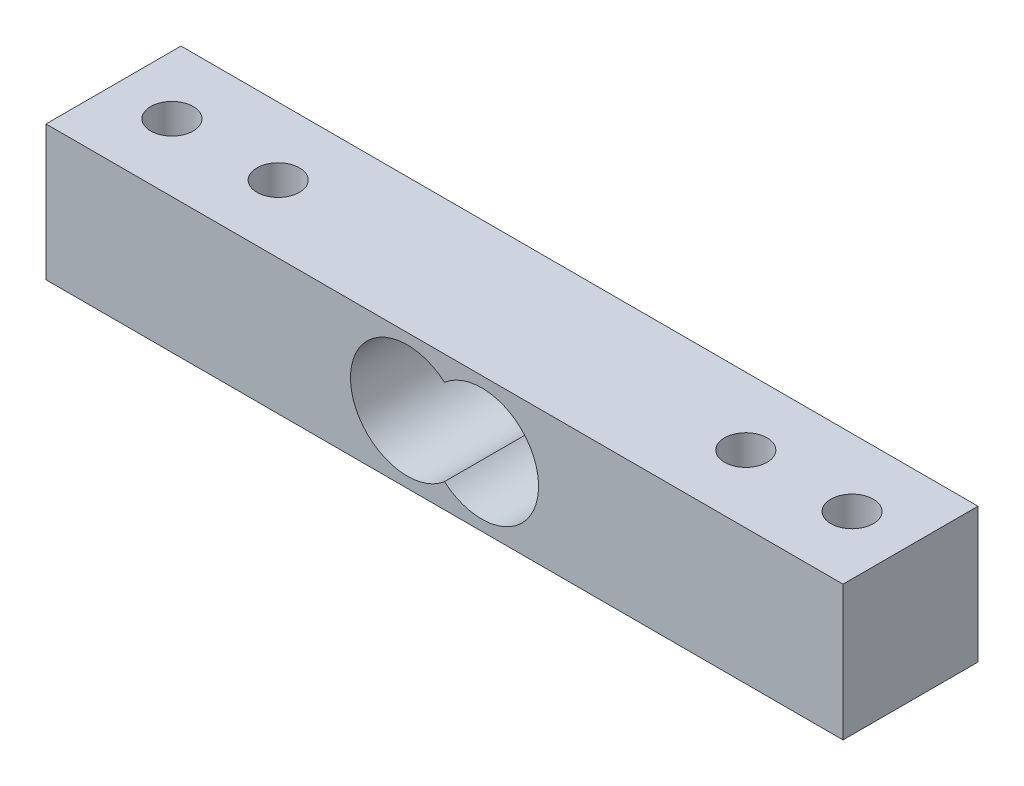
ISO-10303-21;
HEADER;
FILE_DESCRIPTION(('STEP AP214'),'2;1');
FILE_NAME('part.step','',(''),(''),'','','');
FILE_SCHEMA(('AUTOMOTIVE_DESIGN { 1 0 10303 214 1 1 1 1 }'));
ENDSEC;
DATA;
#1=APPLICATION_CONTEXT('core data for automotive mechanical design processes');
#2=APPLICATION_PROTOCOL_DEFINITION('international standard','automotive_design',2000,#1);
#3=PRODUCT_CONTEXT('',#1,'mechanical');
#4=PRODUCT('Part','Part','',(#3));
#5=PRODUCT_RELATED_PRODUCT_CATEGORY('part','',(#4));
#6=PRODUCT_DEFINITION_FORMATION('','',#4);
#7=PRODUCT_DEFINITION_CONTEXT('part definition',#1,'design');
#8=PRODUCT_DEFINITION('design','',#6,#7);
#9=PRODUCT_DEFINITION_SHAPE('','',#8);
#10=(LENGTH_UNIT() NAMED_UNIT(*) SI_UNIT(.MILLI.,.METRE.));
#11=(NAMED_UNIT(*) PLANE_ANGLE_UNIT() SI_UNIT($,.RADIAN.));
#12=(NAMED_UNIT(*) SI_UNIT($,.STERADIAN.) SOLID_ANGLE_UNIT());
#13=UNCERTAINTY_MEASURE_WITH_UNIT(LENGTH_MEASURE(1.E-05),#10,'distance_accuracy_value','');
#14=(GEOMETRIC_REPRESENTATION_CONTEXT(3) GLOBAL_UNCERTAINTY_ASSIGNED_CONTEXT((#13)) GLOBAL_UNIT_ASSIGNED_CONTEXT((#10,
#11,#12)) REPRESENTATION_CONTEXT('',''));
#15=CARTESIAN_POINT('',(0.,0.,0.));
#16=DIRECTION('',(0.,0.,1.));
#17=DIRECTION('',(1.,0.,0.));
#18=AXIS2_PLACEMENT_3D('',#15,#16,#17);
#19=CARTESIAN_POINT('',(0.,12.7,0.));
#20=DIRECTION('',(0.,1.,0.));
#21=DIRECTION('',(0.,0.,1.));
#22=AXIS2_PLACEMENT_3D('',#19,#20,#21);
#23=PLANE('',#22);
#24=CARTESIAN_POINT('',(22.,12.7,0.));
#25=DIRECTION('',(0.,1.,0.));
#26=DIRECTION('',(0.,0.,-1.));
#27=AXIS2_PLACEMENT_3D('',#24,#25,#26);
#28=CIRCLE('',#27,2.);
#29=CARTESIAN_POINT('',(22.,12.7,-2.));
#30=VERTEX_POINT('',#29);
#31=EDGE_CURVE('E130',#30,#30,#28,.T.);
#32=ORIENTED_EDGE('',*,*,#31,.F.);
#33=EDGE_LOOP('',(#32));
#34=FACE_BOUND('',#33,.T.);
#35=CARTESIAN_POINT('',(-22.,12.7,0.));
#36=DIRECTION('',(0.,1.,0.));
#37=DIRECTION('',(0.,0.,1.));
#38=AXIS2_PLACEMENT_3D('',#35,#36,#37);
#39=CIRCLE('',#38,2.);
#40=CARTESIAN_POINT('',(-22.,12.7,2.));
#41=VERTEX_POINT('',#40);
#42=EDGE_CURVE('E146',#41,#41,#39,.T.);
#43=ORIENTED_EDGE('',*,*,#42,.F.);
#44=EDGE_LOOP('',(#43));
#45=FACE_BOUND('',#44,.T.);
#46=DIRECTION('',(0.,0.,1.));
#47=VECTOR('',#46,1.);
#48=CARTESIAN_POINT('',(-37.5,12.7,6.35));
#49=LINE('',#48,#47);
#50=CARTESIAN_POINT('',(-37.5,12.7,-6.35));
#51=VERTEX_POINT('',#50);
#52=CARTESIAN_POINT('',(-37.5,12.7,6.35));
#53=VERTEX_POINT('',#52);
#54=EDGE_CURVE('E154',#51,#53,#49,.T.);
#55=ORIENTED_EDGE('',*,*,#54,.T.);
#56=DIRECTION('',(1.,0.,0.));
#57=VECTOR('',#56,1.);
#58=CARTESIAN_POINT('',(37.5,12.7,6.34999999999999));
#59=LINE('',#58,#57);
#60=CARTESIAN_POINT('',(37.5,12.7,6.34999999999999));
#61=VERTEX_POINT('',#60);
#62=EDGE_CURVE('E158',#53,#61,#59,.T.);
#63=ORIENTED_EDGE('',*,*,#62,.T.);
#64=DIRECTION('',(0.,0.,-1.));
#65=VECTOR('',#64,1.);
#66=CARTESIAN_POINT('',(37.5,12.7,6.34999999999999));
#67=LINE('',#66,#65);
#68=CARTESIAN_POINT('',(37.5,12.7,-6.35000000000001));
#69=VERTEX_POINT('',#68);
#70=EDGE_CURVE('E162',#61,#69,#67,.T.);
#71=ORIENTED_EDGE('',*,*,#70,.T.);
#72=DIRECTION('',(-1.,0.,0.));
#73=VECTOR('',#72,1.);
#74=CARTESIAN_POINT('',(37.5,12.7,-6.35000000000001));
#75=LINE('',#74,#73);
#76=EDGE_CURVE('E165',#69,#51,#75,.T.);
#77=ORIENTED_EDGE('',*,*,#76,.T.);
#78=EDGE_LOOP('',(#55,#63,#71,#77));
#79=FACE_BOUND('',#78,.T.);
#80=CARTESIAN_POINT('',(-32.,12.7,0.));
#81=DIRECTION('',(0.,1.,0.));
#82=DIRECTION('',(0.,0.,1.));
#83=AXIS2_PLACEMENT_3D('',#80,#81,#82);
#84=CIRCLE('',#83,2.);
#85=CARTESIAN_POINT('',(-32.,12.7,2.));
#86=VERTEX_POINT('',#85);
#87=EDGE_CURVE('E138',#86,#86,#84,.T.);
#88=ORIENTED_EDGE('',*,*,#87,.F.);
#89=EDGE_LOOP('',(#88));
#90=FACE_BOUND('',#89,.T.);
#91=CARTESIAN_POINT('',(32.,12.7,0.));
#92=DIRECTION('',(0.,1.,0.));
#93=DIRECTION('',(0.,0.,-1.));
#94=AXIS2_PLACEMENT_3D('',#91,#92,#93);
#95=CIRCLE('',#94,2.);
#96=CARTESIAN_POINT('',(32.,12.7,-2.));
#97=VERTEX_POINT('',#96);
#98=EDGE_CURVE('E122',#97,#97,#95,.T.);
#99=ORIENTED_EDGE('',*,*,#98,.F.);
#100=EDGE_LOOP('',(#99));
#101=FACE_BOUND('',#100,.T.);
#102=ADVANCED_FACE('F44',(#34,#45,#79,#90,#101),#23,.T.);
#103=CARTESIAN_POINT('',(0.,0.,0.));
#104=DIRECTION('',(0.,1.,0.));
#105=DIRECTION('',(0.,0.,1.));
#106=AXIS2_PLACEMENT_3D('',#103,#104,#105);
#107=PLANE('',#106);
#108=DIRECTION('',(0.,0.,1.));
#109=VECTOR('',#108,1.);
#110=CARTESIAN_POINT('',(-37.5,0.,6.35));
#111=LINE('',#110,#109);
#112=CARTESIAN_POINT('',(-37.5,0.,-6.35));
#113=VERTEX_POINT('',#112);
#114=CARTESIAN_POINT('',(-37.5,0.,6.35));
#115=VERTEX_POINT('',#114);
#116=EDGE_CURVE('E150',#113,#115,#111,.T.);
#117=ORIENTED_EDGE('',*,*,#116,.F.);
#118=DIRECTION('',(-1.,0.,0.));
#119=VECTOR('',#118,1.);
#120=CARTESIAN_POINT('',(37.5,0.,-6.35000000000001));
#121=LINE('',#120,#119);
#122=CARTESIAN_POINT('',(37.5,0.,-6.35000000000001));
#123=VERTEX_POINT('',#122);
#124=EDGE_CURVE('E159',#123,#113,#121,.T.);
#125=ORIENTED_EDGE('',*,*,#124,.F.);
#126=DIRECTION('',(0.,0.,-1.));
#127=VECTOR('',#126,1.);
#128=CARTESIAN_POINT('',(37.5,0.,6.34999999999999));
#129=LINE('',#128,#127);
#130=CARTESIAN_POINT('',(37.5,0.,6.34999999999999));
#131=VERTEX_POINT('',#130);
#132=EDGE_CURVE('E175',#131,#123,#129,.T.);
#133=ORIENTED_EDGE('',*,*,#132,.F.);
#134=DIRECTION('',(1.,0.,0.));
#135=VECTOR('',#134,1.);
#136=CARTESIAN_POINT('',(37.5,0.,6.34999999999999));
#137=LINE('',#136,#135);
#138=EDGE_CURVE('E172',#115,#131,#137,.T.);
#139=ORIENTED_EDGE('',*,*,#138,.F.);
#140=EDGE_LOOP('',(#117,#125,#133,#139));
#141=FACE_BOUND('',#140,.T.);
#142=CARTESIAN_POINT('',(-22.,0.,0.));
#143=DIRECTION('',(0.,1.,0.));
#144=DIRECTION('',(0.,0.,1.));
#145=AXIS2_PLACEMENT_3D('',#142,#143,#144);
#146=CIRCLE('',#145,2.);
#147=CARTESIAN_POINT('',(-22.,0.,2.));
#148=VERTEX_POINT('',#147);
#149=EDGE_CURVE('E142',#148,#148,#146,.T.);
#150=ORIENTED_EDGE('',*,*,#149,.T.);
#151=EDGE_LOOP('',(#150));
#152=FACE_BOUND('',#151,.T.);
#153=CARTESIAN_POINT('',(-32.,0.,0.));
#154=DIRECTION('',(0.,1.,0.));
#155=DIRECTION('',(0.,0.,1.));
#156=AXIS2_PLACEMENT_3D('',#153,#154,#155);
#157=CIRCLE('',#156,2.);
#158=CARTESIAN_POINT('',(-32.,0.,2.));
#159=VERTEX_POINT('',#158);
#160=EDGE_CURVE('E134',#159,#159,#157,.T.);
#161=ORIENTED_EDGE('',*,*,#160,.T.);
#162=EDGE_LOOP('',(#161));
#163=FACE_BOUND('',#162,.T.);
#164=CARTESIAN_POINT('',(22.,0.,0.));
#165=DIRECTION('',(0.,1.,0.));
#166=DIRECTION('',(0.,0.,-1.));
#167=AXIS2_PLACEMENT_3D('',#164,#165,#166);
#168=CIRCLE('',#167,2.);
#169=CARTESIAN_POINT('',(22.,0.,-2.));
#170=VERTEX_POINT('',#169);
#171=EDGE_CURVE('E126',#170,#170,#168,.T.);
#172=ORIENTED_EDGE('',*,*,#171,.T.);
#173=EDGE_LOOP('',(#172));
#174=FACE_BOUND('',#173,.T.);
#175=CARTESIAN_POINT('',(32.,0.,0.));
#176=DIRECTION('',(0.,1.,0.));
#177=DIRECTION('',(0.,0.,-1.));
#178=AXIS2_PLACEMENT_3D('',#175,#176,#177);
#179=CIRCLE('',#178,2.);
#180=CARTESIAN_POINT('',(32.,0.,-2.));
#181=VERTEX_POINT('',#180);
#182=EDGE_CURVE('E120',#181,#181,#179,.T.);
#183=ORIENTED_EDGE('',*,*,#182,.T.);
#184=EDGE_LOOP('',(#183));
#185=FACE_BOUND('',#184,.T.);
#186=ADVANCED_FACE('F198',(#141,#152,#163,#174,#185),#107,.F.);
#187=CARTESIAN_POINT('',(-37.5,12.7,6.35));
#188=DIRECTION('',(1.,0.,0.));
#189=DIRECTION('',(0.,0.,-1.));
#190=AXIS2_PLACEMENT_3D('',#187,#188,#189);
#191=PLANE('',#190);
#192=ORIENTED_EDGE('',*,*,#116,.T.);
#193=DIRECTION('',(0.,-1.,0.));
#194=VECTOR('',#193,1.);
#195=CARTESIAN_POINT('',(-37.5,12.7,6.35));
#196=LINE('',#195,#194);
#197=EDGE_CURVE('E11',#53,#115,#196,.T.);
#198=ORIENTED_EDGE('',*,*,#197,.F.);
#199=ORIENTED_EDGE('',*,*,#54,.F.);
#200=DIRECTION('',(0.,-1.,0.));
#201=VECTOR('',#200,1.);
#202=CARTESIAN_POINT('',(-37.5,12.7,-6.35));
#203=LINE('',#202,#201);
#204=EDGE_CURVE('E168',#51,#113,#203,.T.);
#205=ORIENTED_EDGE('',*,*,#204,.T.);
#206=EDGE_LOOP('',(#192,#198,#199,#205));
#207=FACE_BOUND('',#206,.T.);
#208=ADVANCED_FACE('F46',(#207),#191,.F.);
#209=CARTESIAN_POINT('',(37.5,12.7,6.34999999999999));
#210=DIRECTION('',(0.,0.,-1.));
#211=DIRECTION('',(-1.,0.,0.));
#212=AXIS2_PLACEMENT_3D('',#209,#210,#211);
#213=PLANE('',#212);
#214=CARTESIAN_POINT('',(-3.5,6.35,6.34999999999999));
#215=DIRECTION('',(0.,0.,1.));
#216=DIRECTION('',(1.,0.,0.));
#217=AXIS2_PLACEMENT_3D('',#214,#215,#216);
#218=CIRCLE('',#217,5.35);
#219=CARTESIAN_POINT('',(0.,10.396294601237,6.35));
#220=VERTEX_POINT('',#219);
#221=CARTESIAN_POINT('',(0.,2.30370539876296,6.34999999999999));
#222=VERTEX_POINT('',#221);
#223=EDGE_CURVE('E112',#220,#222,#218,.T.);
#224=ORIENTED_EDGE('',*,*,#223,.F.);
#225=CARTESIAN_POINT('',(3.5,6.35,6.34999999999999));
#226=DIRECTION('',(0.,0.,1.));
#227=DIRECTION('',(1.,0.,0.));
#228=AXIS2_PLACEMENT_3D('',#225,#226,#227);
#229=CIRCLE('',#228,5.35);
#230=EDGE_CURVE('E60',#222,#220,#229,.T.);
#231=ORIENTED_EDGE('',*,*,#230,.F.);
#232=EDGE_LOOP('',(#224,#231));
#233=FACE_BOUND('',#232,.T.);
#234=ORIENTED_EDGE('',*,*,#138,.T.);
#235=DIRECTION('',(0.,-1.,0.));
#236=VECTOR('',#235,1.);
#237=CARTESIAN_POINT('',(37.5,12.7,6.34999999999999));
#238=LINE('',#237,#236);
#239=EDGE_CURVE('E53',#61,#131,#238,.T.);
#240=ORIENTED_EDGE('',*,*,#239,.F.);
#241=ORIENTED_EDGE('',*,*,#62,.F.);
#242=ORIENTED_EDGE('',*,*,#197,.T.);
#243=EDGE_LOOP('',(#234,#240,#241,#242));
#244=FACE_BOUND('',#243,.T.);
#245=ADVANCED_FACE('F207',(#233,#244),#213,.F.);
#246=CARTESIAN_POINT('',(37.5,12.7,6.34999999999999));
#247=DIRECTION('',(-1.,0.,0.));
#248=DIRECTION('',(0.,0.,1.));
#249=AXIS2_PLACEMENT_3D('',#246,#247,#248);
#250=PLANE('',#249);
#251=ORIENTED_EDGE('',*,*,#132,.T.);
#252=DIRECTION('',(0.,-1.,0.));
#253=VECTOR('',#252,1.);
#254=CARTESIAN_POINT('',(37.5,12.7,-6.35000000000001));
#255=LINE('',#254,#253);
#256=EDGE_CURVE('E183',#69,#123,#255,.T.);
#257=ORIENTED_EDGE('',*,*,#256,.F.);
#258=ORIENTED_EDGE('',*,*,#70,.F.);
#259=ORIENTED_EDGE('',*,*,#239,.T.);
#260=EDGE_LOOP('',(#251,#257,#258,#259));
#261=FACE_BOUND('',#260,.T.);
#262=ADVANCED_FACE('F192',(#261),#250,.F.);
#263=CARTESIAN_POINT('',(37.5,12.7,-6.35000000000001));
#264=DIRECTION('',(0.,0.,1.));
#265=DIRECTION('',(1.,0.,0.));
#266=AXIS2_PLACEMENT_3D('',#263,#264,#265);
#267=PLANE('',#266);
#268=CARTESIAN_POINT('',(-3.5,6.35,-6.35));
#269=DIRECTION('',(0.,0.,1.));
#270=DIRECTION('',(1.,0.,0.));
#271=AXIS2_PLACEMENT_3D('',#268,#269,#270);
#272=CIRCLE('',#271,5.35);
#273=CARTESIAN_POINT('',(0.,10.396294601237,-6.35));
#274=VERTEX_POINT('',#273);
#275=CARTESIAN_POINT('',(0.,2.30370539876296,-6.35));
#276=VERTEX_POINT('',#275);
#277=EDGE_CURVE('E102',#274,#276,#272,.T.);
#278=ORIENTED_EDGE('',*,*,#277,.T.);
#279=CARTESIAN_POINT('',(3.5,6.35,-6.35));
#280=DIRECTION('',(0.,0.,1.));
#281=DIRECTION('',(1.,0.,0.));
#282=AXIS2_PLACEMENT_3D('',#279,#280,#281);
#283=CIRCLE('',#282,5.35);
#284=EDGE_CURVE('E65',#276,#274,#283,.T.);
#285=ORIENTED_EDGE('',*,*,#284,.T.);
#286=EDGE_LOOP('',(#278,#285));
#287=FACE_BOUND('',#286,.T.);
#288=ORIENTED_EDGE('',*,*,#124,.T.);
#289=ORIENTED_EDGE('',*,*,#204,.F.);
#290=ORIENTED_EDGE('',*,*,#76,.F.);
#291=ORIENTED_EDGE('',*,*,#256,.T.);
#292=EDGE_LOOP('',(#288,#289,#290,#291));
#293=FACE_BOUND('',#292,.T.);
#294=ADVANCED_FACE('F109',(#287,#293),#267,.F.);
#295=CARTESIAN_POINT('',(-22.,12.7,0.));
#296=DIRECTION('',(0.,-1.,0.));
#297=DIRECTION('',(0.,0.,-1.));
#298=AXIS2_PLACEMENT_3D('',#295,#296,#297);
#299=CYLINDRICAL_SURFACE('',#298,2.);
#300=ORIENTED_EDGE('',*,*,#42,.T.);
#301=EDGE_LOOP('',(#300));
#302=FACE_BOUND('',#301,.T.);
#303=ORIENTED_EDGE('',*,*,#149,.F.);
#304=EDGE_LOOP('',(#303));
#305=FACE_BOUND('',#304,.T.);
#306=ADVANCED_FACE('F227',(#302,#305),#299,.F.);
#307=CARTESIAN_POINT('',(-32.,12.7,0.));
#308=DIRECTION('',(0.,-1.,0.));
#309=DIRECTION('',(0.,0.,-1.));
#310=AXIS2_PLACEMENT_3D('',#307,#308,#309);
#311=CYLINDRICAL_SURFACE('',#310,2.);
#312=ORIENTED_EDGE('',*,*,#87,.T.);
#313=EDGE_LOOP('',(#312));
#314=FACE_BOUND('',#313,.T.);
#315=ORIENTED_EDGE('',*,*,#160,.F.);
#316=EDGE_LOOP('',(#315));
#317=FACE_BOUND('',#316,.T.);
#318=ADVANCED_FACE('F234',(#314,#317),#311,.F.);
#319=CARTESIAN_POINT('',(22.,12.7,0.));
#320=DIRECTION('',(0.,-1.,0.));
#321=DIRECTION('',(0.,0.,-1.));
#322=AXIS2_PLACEMENT_3D('',#319,#320,#321);
#323=CYLINDRICAL_SURFACE('',#322,2.);
#324=ORIENTED_EDGE('',*,*,#31,.T.);
#325=EDGE_LOOP('',(#324));
#326=FACE_BOUND('',#325,.T.);
#327=ORIENTED_EDGE('',*,*,#171,.F.);
#328=EDGE_LOOP('',(#327));
#329=FACE_BOUND('',#328,.T.);
#330=ADVANCED_FACE('F239',(#326,#329),#323,.F.);
#331=CARTESIAN_POINT('',(32.,12.7,0.));
#332=DIRECTION('',(0.,-1.,0.));
#333=DIRECTION('',(0.,0.,-1.));
#334=AXIS2_PLACEMENT_3D('',#331,#332,#333);
#335=CYLINDRICAL_SURFACE('',#334,2.);
#336=ORIENTED_EDGE('',*,*,#98,.T.);
#337=EDGE_LOOP('',(#336));
#338=FACE_BOUND('',#337,.T.);
#339=ORIENTED_EDGE('',*,*,#182,.F.);
#340=EDGE_LOOP('',(#339));
#341=FACE_BOUND('',#340,.T.);
#342=ADVANCED_FACE('F251',(#338,#341),#335,.F.);
#343=CARTESIAN_POINT('',(3.5,6.35,-6.35));
#344=DIRECTION('',(0.,0.,1.));
#345=DIRECTION('',(1.,0.,0.));
#346=AXIS2_PLACEMENT_3D('',#343,#344,#345);
#347=CYLINDRICAL_SURFACE('',#346,5.35);
#348=ORIENTED_EDGE('',*,*,#230,.T.);
#349=DIRECTION('',(0.,0.,1.));
#350=VECTOR('',#349,1.);
#351=CARTESIAN_POINT('',(0.,10.396294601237,-6.35));
#352=LINE('',#351,#350);
#353=EDGE_CURVE('E94',#274,#220,#352,.T.);
#354=ORIENTED_EDGE('',*,*,#353,.F.);
#355=ORIENTED_EDGE('',*,*,#284,.F.);
#356=DIRECTION('',(0.,0.,1.));
#357=VECTOR('',#356,1.);
#358=CARTESIAN_POINT('',(0.,2.30370539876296,-6.35));
#359=LINE('',#358,#357);
#360=EDGE_CURVE('E101',#276,#222,#359,.T.);
#361=ORIENTED_EDGE('',*,*,#360,.T.);
#362=EDGE_LOOP('',(#348,#354,#355,#361));
#363=FACE_BOUND('',#362,.T.);
#364=ADVANCED_FACE('F96',(#363),#347,.F.);
#365=CARTESIAN_POINT('',(-3.5,6.35,-6.35));
#366=DIRECTION('',(0.,0.,1.));
#367=DIRECTION('',(1.,0.,0.));
#368=AXIS2_PLACEMENT_3D('',#365,#366,#367);
#369=CYLINDRICAL_SURFACE('',#368,5.35);
#370=ORIENTED_EDGE('',*,*,#223,.T.);
#371=ORIENTED_EDGE('',*,*,#360,.F.);
#372=ORIENTED_EDGE('',*,*,#277,.F.);
#373=ORIENTED_EDGE('',*,*,#353,.T.);
#374=EDGE_LOOP('',(#370,#371,#372,#373));
#375=FACE_BOUND('',#374,.T.);
#376=ADVANCED_FACE('F105',(#375),#369,.F.);
#377=CLOSED_SHELL('',(#102,#186,#208,#245,#262,#294,#306,#318,#330,#342,#364,#376));
#378=MANIFOLD_SOLID_BREP('B2',#377);
#379=ADVANCED_BREP_SHAPE_REPRESENTATION('',(#18,#378),#14);
#380=SHAPE_DEFINITION_REPRESENTATION(#9,#379);
ENDSEC;
END-ISO-10303-21;
